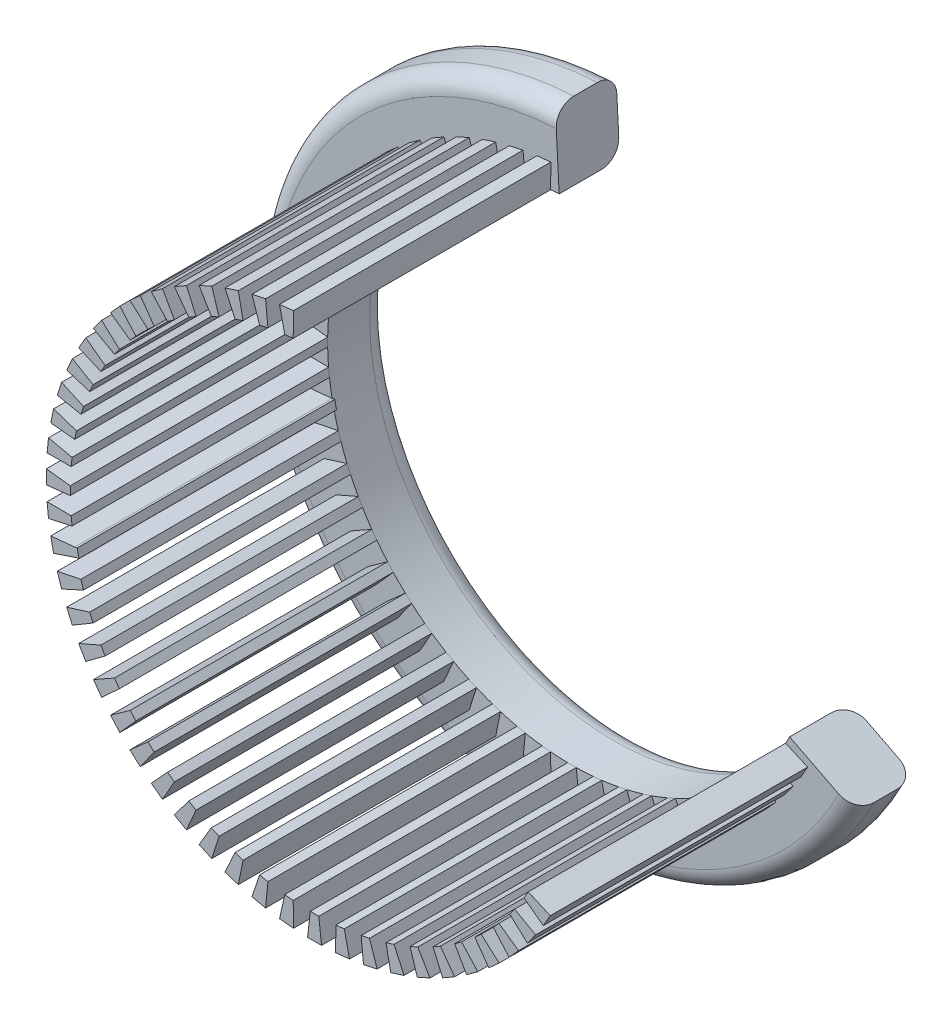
from build123d import *

# Parameters (mm, degrees)
P_IDAT_VYSUNUT_M1_DEPTH       = 85
SKICA2_R                      = 105
SKICA2_R_2                    = 80.668980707
P_IDAT_VYSUNUT_M2_DEPTH       = 20
SKICA4_W                      = 5
SKICA4_H                      = 15
P_IDAT_VYSUNUT_M3_DEPTH       = 60
ODEBRAT_VYSUNUT_M2_DEPTH      = 80
LINPOLE3_COUNT                = 3
LINPOLE3_PITCH                = 20
ODEBRAT_VYSUNUT_M3_DEPTH      = 80
ODEBRAT_VYSUNUT_M4_DEPTH      = 80
M_TKO1_SCALE                  = 0.655
ODEBRAT_VYSUNUT_M5_DEPTH      = 113.070098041
ODEBRAT_VYSUNUT_M5_DEPTH_BACK = 113.070098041
ZAOBLIT1_R                    = 4


with BuildPart() as part:
    # Skica1 → P_idat vysunut_m1 (new body)
    with BuildSketch(Plane.XY):
        Polygon((-84.927900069, 25.177890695), (-77.136438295, 23.592607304), (-76.271190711, 26.25556555), (-83.506421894, 29.55275067), align=None)
        Polygon((-81.830813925, 33.917858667), (-74.247741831, 31.526830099), (-73.108879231, 34.08475738), (-79.959825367, 38.120167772), align=None)
        Polygon((-77.837118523, 42.286214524), (-70.545517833, 39.115637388), (-69.145517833, 41.540508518), (-75.537118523, 46.269931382), align=None)
        Polygon((-72.990569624, 50.19127281), (-66.070328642, 46.275884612), (-64.424529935, 48.541132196), (-70.286757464, 53.912750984), align=None)
        Polygon((-67.344267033, 57.54642405), (-60.871205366, 52.929122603), (-58.997639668, 55.009928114), (-64.266266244, 60.964890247), align=None)
        Polygon((-60.960072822, 64.271083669), (-55.005110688, 59.002457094), (-52.924305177, 60.876022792), (-57.541606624, 67.349084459), align=None)
        Polygon((-53.907933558, 70.29157489), (-48.53631477, 64.429347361), (-46.271067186, 66.075146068), (-50.186455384, 72.99538705), align=None)
        Polygon((-46.265113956, 75.541935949), (-41.535691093, 69.150335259), (-39.110819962, 70.550335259), (-42.281397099, 77.841935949), align=None)
        Polygon((-38.115350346, 79.964642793), (-34.079939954, 73.113696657), (-31.522012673, 74.252559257), (-33.913041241, 81.835631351), align=None)
        Polygon((-29.547933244, 83.51123932), (-26.250748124, 76.276008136), (-23.587789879, 77.141255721), (-25.173073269, 84.932717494), align=None)
        Polygon((-20.656729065, 86.142868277), (-18.133893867, 78.602622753), (-15.395080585, 79.184775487), (-16.157250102, 87.099262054), align=None)
        Polygon((-11.539151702, 87.830696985), (-9.818307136, 80.068049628), (-7.033645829, 80.360729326), (-6.964350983, 88.311527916), align=None)
        Polygon((-87.094444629, 16.162067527), (-79.179958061, 15.399898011), (-78.597805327, 18.138711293), (-86.138050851, 20.661546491), align=None)
        Polygon((-88.30671049, 6.969168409), (-80.3559119, 7.038463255), (-80.063232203, 9.823124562), (-87.825879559, 11.543969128), align=None)
        Polygon((-87.825879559, -11.544143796), (-80.063232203, -9.82329923), (-80.3559119, -7.038637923), (-88.30671049, -6.969343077), align=None)
        Polygon((-83.506421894, -29.552925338), (-76.271190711, -26.255740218), (-77.136438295, -23.592781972), (-84.927900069, -25.178065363), align=None)
        Polygon((-88.551415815, -2.300087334), (-80.651415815, -1.400087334), (-80.651415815, 1.399912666), (-88.551415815, 2.299912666), align=None)
        Polygon((-79.959825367, -38.12034244), (-73.108879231, -34.084932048), (-74.247741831, -31.527004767), (-81.830813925, -33.918033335), align=None)
        Polygon((-75.537118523, -46.27010605), (-69.145517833, -41.540683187), (-70.545517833, -39.115812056), (-77.837118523, -42.286389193), align=None)
        Polygon((-70.286757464, -53.912925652), (-64.424529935, -48.541306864), (-66.070328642, -46.27605928), (-72.990569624, -50.191447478), align=None)
        Polygon((-64.266266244, -60.965064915), (-58.997639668, -55.010102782), (-60.871205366, -52.929297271), (-67.344267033, -57.546598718), align=None)
        Polygon((-57.541606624, -67.349259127), (-52.924305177, -60.87619746), (-55.005110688, -59.002631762), (-60.960072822, -64.271258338), align=None)
        Polygon((-53.907933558, -70.291749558), (-48.53631477, -64.429522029), (-46.271067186, -66.075320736), (-50.186455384, -72.995561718), align=None)
        Polygon((-46.265113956, -75.542110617), (-41.535691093, -69.150509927), (-39.110819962, -70.550509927), (-42.281397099, -77.842110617), align=None)
        Polygon((-38.115350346, -79.964817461), (-34.079939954, -73.113871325), (-31.522012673, -74.252733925), (-33.913041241, -81.835806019), align=None)
        Polygon((-29.547933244, -83.511413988), (-26.250748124, -76.276182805), (-23.587789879, -77.141430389), (-25.173073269, -84.932892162), align=None)
        Polygon((-20.656729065, -86.143042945), (-18.133893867, -78.602797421), (-15.395080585, -79.184950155), (-16.157250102, -87.099436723), align=None)
        Polygon((-11.539151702, -87.830871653), (-9.818307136, -80.068224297), (-7.033645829, -80.360903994), (-6.964350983, -88.311702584), align=None)
        Polygon((-2.29509524, -88.556407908), (-1.39509524, -80.656407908), (1.40490476, -80.656407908), (2.30490476, -88.556407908), align=None)
        Polygon((6.974160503, -88.311702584), (7.043455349, -80.360903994), (9.828116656, -80.068224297), (11.548961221, -87.830871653), align=None)
        Polygon((16.167059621, -87.099436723), (15.404890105, -79.184950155), (18.143703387, -78.602797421), (20.666538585, -86.143042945), align=None)
        Polygon((25.182882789, -84.932892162), (23.597599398, -77.141430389), (26.260557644, -76.276182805), (29.557742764, -83.511413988), align=None)
        Polygon((33.922850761, -81.835806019), (31.531822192, -74.252733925), (34.089749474, -73.113871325), (38.125159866, -79.964817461), align=None)
        Polygon((42.291206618, -77.842110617), (39.120629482, -70.550509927), (41.545500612, -69.150509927), (46.274923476, -75.542110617), align=None)
        Polygon((50.196264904, -72.995561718), (46.280876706, -66.075320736), (48.54612429, -64.429522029), (53.917743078, -70.291749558), align=None)
        Polygon((57.551416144, -67.349259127), (52.934114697, -60.87619746), (55.014920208, -59.002631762), (60.969882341, -64.271258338), align=None)
        Polygon((64.276075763, -60.965064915), (59.007449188, -55.010102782), (60.881014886, -52.929297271), (67.354076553, -57.546598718), align=None)
        Polygon((70.296566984, -53.912925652), (64.434339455, -48.541306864), (66.080138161, -46.27605928), (73.000379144, -50.191447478), align=None)
        Polygon((75.546928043, -46.27010605), (69.155327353, -41.540683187), (70.555327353, -39.115812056), (77.846928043, -42.286389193), align=None)
        Polygon((79.969634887, -38.12034244), (73.11868875, -34.084932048), (74.257551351, -31.527004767), (81.840623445, -33.918033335), align=None)
        Polygon((83.516231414, -29.552925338), (76.28100023, -26.255740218), (77.146247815, -23.592781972), (84.937709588, -25.178065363), align=None)
        Polygon((86.147860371, -20.661721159), (78.607614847, -18.138885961), (79.189767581, -15.400072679), (87.104254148, -16.162242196), align=None)
        Polygon((87.835689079, -11.544143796), (80.073041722, -9.82329923), (80.365721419, -7.038637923), (88.31652001, -6.969343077), align=None)
        Polygon((88.561225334, -2.300087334), (80.661225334, -1.400087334), (80.661225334, 1.399912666), (88.561225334, 2.299912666), align=None)
        Polygon((88.31652001, 6.969168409), (80.365721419, 7.038463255), (80.073041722, 9.823124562), (87.835689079, 11.543969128), align=None)
        Polygon((87.104254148, 16.162067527), (79.189767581, 15.399898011), (78.607614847, 18.138711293), (86.147860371, 20.661546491), align=None)
        Polygon((84.937709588, 25.177890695), (77.146247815, 23.592607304), (76.28100023, 26.25556555), (83.516231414, 29.55275067), align=None)
        Polygon((81.840623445, 33.917858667), (74.257551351, 31.526830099), (73.11868875, 34.08475738), (79.969634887, 38.120167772), align=None)
        Polygon((77.846928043, 42.286214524), (70.555327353, 39.115637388), (69.155327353, 41.540508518), (75.546928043, 46.269931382), align=None)
        Polygon((73.000379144, 50.19127281), (66.080138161, 46.275884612), (64.434339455, 48.541132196), (70.296566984, 53.912750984), align=None)
        Polygon((67.354076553, 57.54642405), (60.881014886, 52.929122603), (59.007449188, 55.009928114), (64.276075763, 60.964890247), align=None)
        Polygon((60.969882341, 64.271083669), (55.014920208, 59.002457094), (52.934114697, 60.876022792), (57.551416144, 67.349084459), align=None)
        Polygon((53.917743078, 70.29157489), (48.54612429, 64.429347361), (46.280876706, 66.075146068), (50.196264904, 72.99538705), align=None)
        Polygon((46.274923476, 75.541935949), (41.545500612, 69.150335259), (39.120629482, 70.550335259), (42.291206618, 77.841935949), align=None)
        Polygon((38.125159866, 79.964642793), (34.089749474, 73.113696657), (31.531822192, 74.252559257), (33.922850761, 81.835631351), align=None)
        Polygon((29.557742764, 83.51123932), (26.260557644, 76.276008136), (23.597599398, 77.141255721), (25.182882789, 84.932717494), align=None)
        Polygon((20.666538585, 86.142868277), (18.143703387, 78.602622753), (15.404890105, 79.184775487), (16.167059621, 87.099262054), align=None)
        Polygon((11.548961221, 87.830696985), (9.828116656, 80.068049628), (7.043455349, 80.360729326), (6.974160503, 88.311527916), align=None)
        Polygon((0.00490476, 80.65623324), (1.40490476, 80.65623324), (2.30490476, 88.55623324), (0.00490476, 88.55623324), align=None)
        Polygon((-1.39509524, 80.65623324), (0.00490476, 80.65623324), (0.00490476, 88.55623324), (-2.29509524, 88.55623324), align=None)
        Polygon((-86.138050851, -20.661721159), (-87.094444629, -16.162242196), (-79.179958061, -15.400072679), (-78.341415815, -15.226849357), (-77.761302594, -17.956067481), (-78.597805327, -18.138885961), align=None)
    extrude(amount=P_IDAT_VYSUNUT_M1_DEPTH)

    # Skica2 → P_idat vysunut_m2 (add)
    with BuildSketch(Plane.XY):
        Circle(SKICA2_R)
        Circle(SKICA2_R_2, mode=Mode.SUBTRACT)
    extrude(amount=-P_IDAT_VYSUNUT_M2_DEPTH)

    # Skica4 → P_idat vysunut_m3 (add)
    with BuildSketch(Plane(origin=(0, 0, -20), x_dir=(-1, 0, 0), z_dir=(0, 0, -1))):
        with Locations((-94, 19.997523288)):
            Rectangle(SKICA4_W, SKICA4_H)
    p_idat_vysunut_m3 = extrude(amount=P_IDAT_VYSUNUT_M3_DEPTH)

    # Skica5 → Odebrat vysunut_m2 (cut)
    with BuildSketch(Plane.ZY.offset(-91.5)):
        with BuildLine():
            Line((-80, 27.497523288), (-80, 19.997523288))
            ThreePointArc((-80, 19.997523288), (-77.803300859, 25.300824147), (-72.5, 27.497523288))
            Line((-72.5, 27.497523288), (-80, 27.497523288))
        make_face()
        with BuildLine():
            ThreePointArc((-72.5, 12.497523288), (-77.803300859, 14.694222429), (-80, 19.997523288))
            Line((-80, 19.997523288), (-80, 12.497523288))
            Line((-80, 12.497523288), (-72.5, 12.497523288))
        make_face()
        with BuildLine():
            ThreePointArc((-72.5, 23.997523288), (-75.328427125, 22.825950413), (-76.5, 19.997523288))
            Line((-76.5, 19.997523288), (-72.5, 19.997523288))
            Line((-72.5, 19.997523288), (-72.5, 23.997523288))
        make_face()
        with BuildLine():
            Line((-72.5, 19.997523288), (-76.5, 19.997523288))
            ThreePointArc((-76.5, 19.997523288), (-75.328427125, 17.169096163), (-72.5, 15.997523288))
            Line((-72.5, 15.997523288), (-72.5, 19.997523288))
        make_face()
        with BuildLine():
            ThreePointArc((-72.5, 23.997523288), (-75.328427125, 22.825950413), (-76.5, 19.997523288))
            Line((-76.5, 19.997523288), (-72.5, 19.997523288))
            Line((-72.5, 19.997523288), (-72.5, 23.997523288))
        make_face()
        with BuildLine():
            Line((-72.5, 19.997523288), (-76.5, 19.997523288))
            ThreePointArc((-76.5, 19.997523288), (-75.328427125, 17.169096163), (-72.5, 15.997523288))
            Line((-72.5, 15.997523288), (-72.5, 19.997523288))
        make_face()
        with BuildLine():
            Line((-72.5, 23.997523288), (-72.5, 19.997523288))
            Line((-72.5, 19.997523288), (-72.5, 15.997523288))
            ThreePointArc((-72.5, 15.997523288), (-69.671572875, 17.169096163), (-68.5, 19.997523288))
            ThreePointArc((-68.5, 19.997523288), (-69.671572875, 22.825950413), (-72.5, 23.997523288))
        make_face()
    extrude(amount=-ODEBRAT_VYSUNUT_M2_DEPTH, mode=Mode.SUBTRACT)

    # LinPole3: P_idat vysunut_m3 ×3
    with Locations(*[(0, -i * LINPOLE3_PITCH, 0) for i in range(1, LINPOLE3_COUNT)]):
        add(p_idat_vysunut_m3)

    # Skica8 → Odebrat vysunut_m3 (cut)
    with BuildSketch(Plane.ZY.offset(-91.5)):
        with BuildLine():
            Line((-80, 7.497523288), (-80, -0.002476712))
            ThreePointArc((-80, -0.002476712), (-77.803300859, 5.300824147), (-72.5, 7.497523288))
            Line((-72.5, 7.497523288), (-80, 7.497523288))
        make_face()
        with BuildLine():
            ThreePointArc((-72.5, -7.502476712), (-77.803300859, -5.305777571), (-80, -0.002476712))
            Line((-80, -0.002476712), (-80, -7.502476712))
            Line((-80, -7.502476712), (-72.5, -7.502476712))
        make_face()
        with BuildLine():
            ThreePointArc((-72.5, 3.997523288), (-75.328427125, 2.825950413), (-76.5, -0.002476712))
            Line((-76.5, -0.002476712), (-72.5, -0.002476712))
            Line((-72.5, -0.002476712), (-72.5, 3.997523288))
        make_face()
        with BuildLine():
            Line((-72.5, -0.002476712), (-76.5, -0.002476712))
            ThreePointArc((-76.5, -0.002476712), (-75.328427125, -2.830903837), (-72.5, -4.002476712))
            Line((-72.5, -4.002476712), (-72.5, -0.002476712))
        make_face()
        with BuildLine():
            ThreePointArc((-72.5, 3.997523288), (-75.328427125, 2.825950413), (-76.5, -0.002476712))
            Line((-76.5, -0.002476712), (-72.5, -0.002476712))
            Line((-72.5, -0.002476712), (-72.5, 3.997523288))
        make_face()
        with BuildLine():
            Line((-72.5, -0.002476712), (-76.5, -0.002476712))
            ThreePointArc((-76.5, -0.002476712), (-75.328427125, -2.830903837), (-72.5, -4.002476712))
            Line((-72.5, -4.002476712), (-72.5, -0.002476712))
        make_face()
        with BuildLine():
            Line((-72.5, 3.997523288), (-72.5, -0.002476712))
            Line((-72.5, -0.002476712), (-72.5, -4.002476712))
            ThreePointArc((-72.5, -4.002476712), (-69.671572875, -2.830903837), (-68.5, -0.002476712))
            ThreePointArc((-68.5, -0.002476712), (-69.671572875, 2.825950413), (-72.5, 3.997523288))
        make_face()
    extrude(amount=-ODEBRAT_VYSUNUT_M3_DEPTH, mode=Mode.SUBTRACT)

    # Skica9 → Odebrat vysunut_m4 (cut)
    with BuildSketch(Plane.ZY.offset(-91.5)):
        with BuildLine():
            Line((-80, -12.502476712), (-80, -20.002476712))
            ThreePointArc((-80, -20.002476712), (-77.803300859, -14.699175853), (-72.5, -12.502476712))
            Line((-72.5, -12.502476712), (-80, -12.502476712))
        make_face()
        with BuildLine():
            ThreePointArc((-72.5, -27.502476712), (-77.803300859, -25.305777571), (-80, -20.002476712))
            Line((-80, -20.002476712), (-80, -27.502476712))
            Line((-80, -27.502476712), (-72.5, -27.502476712))
        make_face()
        with BuildLine():
            ThreePointArc((-72.5, -16.002476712), (-75.328427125, -17.174049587), (-76.5, -20.002476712))
            Line((-76.5, -20.002476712), (-72.5, -20.002476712))
            Line((-72.5, -20.002476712), (-72.5, -16.002476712))
        make_face()
        with BuildLine():
            Line((-72.5, -20.002476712), (-76.5, -20.002476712))
            ThreePointArc((-76.5, -20.002476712), (-75.328427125, -22.830903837), (-72.5, -24.002476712))
            Line((-72.5, -24.002476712), (-72.5, -20.002476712))
        make_face()
        with BuildLine():
            Line((-72.5, -16.002476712), (-72.5, -20.002476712))
            Line((-72.5, -20.002476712), (-72.5, -24.002476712))
            ThreePointArc((-72.5, -24.002476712), (-69.671572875, -22.830903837), (-68.5, -20.002476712))
            ThreePointArc((-68.5, -20.002476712), (-69.671572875, -17.174049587), (-72.5, -16.002476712))
        make_face()
        with BuildLine():
            ThreePointArc((-72.5, -16.002476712), (-75.328427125, -17.174049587), (-76.5, -20.002476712))
            Line((-76.5, -20.002476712), (-72.5, -20.002476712))
            Line((-72.5, -20.002476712), (-72.5, -16.002476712))
        make_face()
        with BuildLine():
            Line((-72.5, -20.002476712), (-76.5, -20.002476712))
            ThreePointArc((-76.5, -20.002476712), (-75.328427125, -22.830903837), (-72.5, -24.002476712))
            Line((-72.5, -24.002476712), (-72.5, -20.002476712))
        make_face()
    extrude(amount=-ODEBRAT_VYSUNUT_M4_DEPTH, mode=Mode.SUBTRACT)


with BuildPart() as part_1:
    # M_tko1: scaled about (0, 0, 0)
    add(part.part.scale(M_TKO1_SCALE))

    # Skica10 → Odebrat vysunut_m5 (cut, two sides: drawn at the far end of the back side and taken through both)
    with BuildSketch(Plane.XY.offset(-ODEBRAT_VYSUNUT_M5_DEPTH_BACK)):
        with BuildLine():
            Line((-5.154354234, 98.261553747), (0, 0))
            Line((0, 0), (87.674178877, -44.666975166))
            ThreePointArc((87.674178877, -44.666975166), (95.678486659, -22.967966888), (98.396647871, 0))
            ThreePointArc((98.396647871, 0), (67.730086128, 71.376016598), (-5.154354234, 98.261553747))
        make_face()
    extrude(amount=ODEBRAT_VYSUNUT_M5_DEPTH + ODEBRAT_VYSUNUT_M5_DEPTH_BACK, mode=Mode.SUBTRACT)

    # Zaoblit1
    zaoblit1_edges = [part_1.edges().sort_by_distance(p)[0] for p in [
        (-57.677787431, -37.460291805, 0),
        (-57.677787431, -37.460291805, -13.1),
        (-44.312460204, -28.779843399, -13.1),
    ]]
    fillet(zaoblit1_edges, radius=ZAOBLIT1_R)


solid = part_1.part
